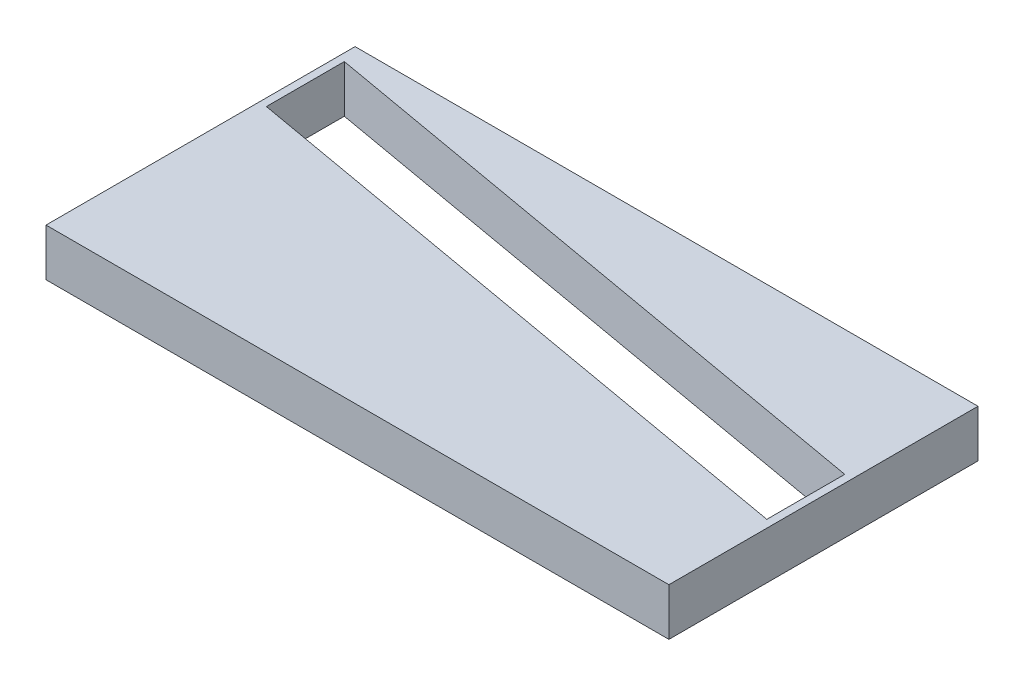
from build123d import *

# Parameters (mm, degrees)
SKETCH1_W          = 1336.04
SKETCH1_H          = 662.94
EXTRUDE1_DEPTH     = 50.8
CUT_EXTRUDE1_DEPTH = 753.625830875


with BuildPart() as part:
    # Sketch1 → Extrude1 (new, symmetric)
    with BuildSketch(Plane(origin=(0, 0, 0), x_dir=(1, 0, 0), z_dir=(0, 1, 0))):
        Rectangle(SKETCH1_W, SKETCH1_H)
    extrude(amount=EXTRUDE1_DEPTH, both=True)

    # Sketch2 → Cut-Extrude1 (cut, through all)
    with BuildSketch(Plane(origin=(0, 50.8, 0), x_dir=(1, 0, 0), z_dir=(0, 1, 0))):
        Polygon((-651.770079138, 292.123774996), (651.588952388, 62.084893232), (651.559362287, -105.045841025), (-651.799669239, 124.99304074), align=None)
    extrude(amount=-CUT_EXTRUDE1_DEPTH, mode=Mode.SUBTRACT)


solid = part.part
